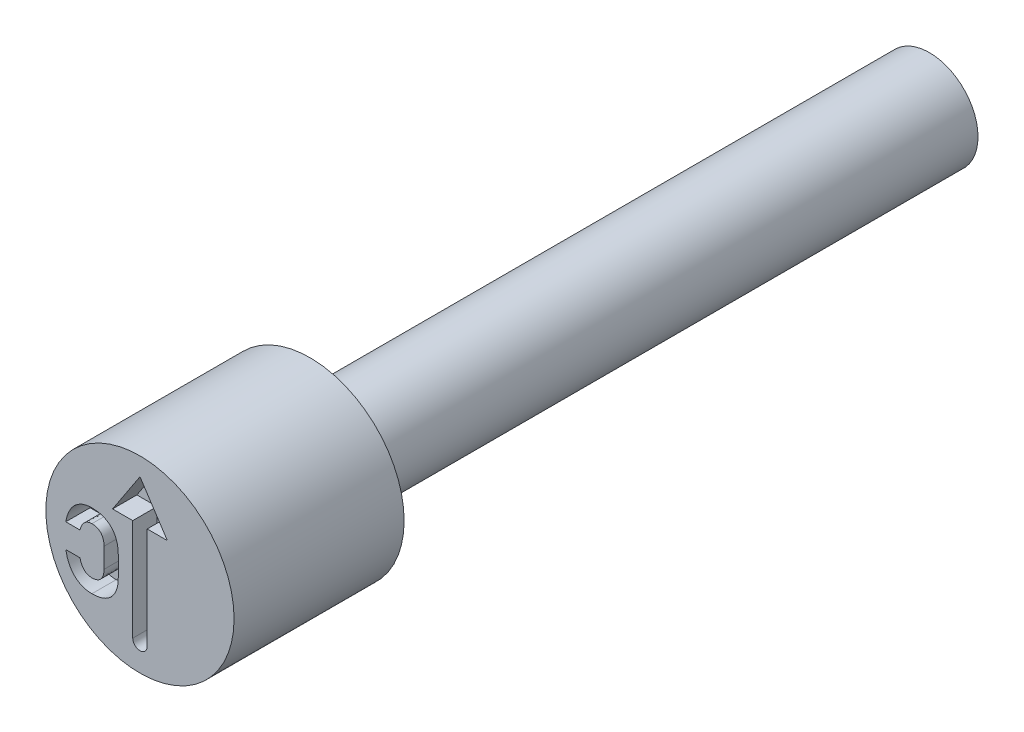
from build123d import *

# Parameters (mm, degrees)
CUT_EXTRUDE4_DEPTH = 0.4
CUT_EXTRUDE5_DEPTH = 0.4


with BuildPart() as part:
    # Sketch2 → Revolve1 (revolve)
    with BuildSketch(Plane(origin=(0, 0, 0), x_dir=(0, 0, -1), z_dir=(1, 0, 0)), mode=Mode.PRIVATE) as revolve1_sk:
        Polygon((0, 1.55), (0, 0), (13, 0), (13, 0.8), (2.8, 0.8), (2.8, 1.55), align=None)
    revolve(revolve1_sk.sketch.rotate(Axis((0, 0, -0.403888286), (0, 0, -1)), 90), axis=Axis((0, 0, -0.403888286), (0, 0, -1)))

    # Sketch3 → Cut-Extrude4 (cut)
    with BuildSketch(Plane.XY):
        with BuildLine():
            Line((0.119045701, 0.566469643), (0.119045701, -1.110101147))
            ThreePointArc((0.119045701, -1.110101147), (0, -1.229146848), (-0.119045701, -1.110101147))
            Line((-0.119045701, -1.110101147), (-0.119045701, 0.566469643))
            Line((-0.119045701, 0.566469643), (-0.451198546, 0.566469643))
            Line((-0.451198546, 0.566469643), (0, 1.251322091))
            Line((0, 1.251322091), (0.451198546, 0.566469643))
            Line((0.451198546, 0.566469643), (0.119045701, 0.566469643))
        make_face()
    extrude(amount=-CUT_EXTRUDE4_DEPTH, mode=Mode.SUBTRACT)

    # Sketch4 → Cut-Extrude5 (cut)
    with BuildSketch(Plane.XY):
        with BuildLine():
            add(Edge.make_bspline(
                [(-0.791430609, -0.812471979), (-0.780258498, -0.812351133), (-0.75821246, -0.812112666), (-0.725795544, -0.809631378), (-0.694521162, -0.805483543), (-0.664559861, -0.799634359), (-0.635828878, -0.792255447), (-0.608205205, -0.783533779), (-0.581954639, -0.772736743), (-0.556822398, -0.760492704), (-0.533162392, -0.746634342), (-0.511024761, -0.731046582), (-0.490189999, -0.714218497), (-0.470816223, -0.695812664), (-0.452923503, -0.675936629), (-0.436410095, -0.654568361), (-0.421615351, -0.631571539), (-0.408081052, -0.607256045), (-0.396039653, -0.581555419), (-0.38587658, -0.554346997), (-0.377065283, -0.525931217), (-0.369694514, -0.496312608), (-0.364051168, -0.465356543), (-0.36028953, -0.433086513), (-0.357681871, -0.39947215), (-0.357466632, -0.376610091), (-0.357356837, -0.364948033)],
                knots=[0, 0, 0, 0, 1.134237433, 2.238201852, 3.298772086, 4.336057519, 5.335809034, 6.309558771, 7.274828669, 8.21507465, 9.146315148, 10.055631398, 10.961815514, 11.863452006, 12.765999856, 13.674901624, 14.60241943, 15.539819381, 16.498894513, 17.481225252, 18.486546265, 19.518401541, 20.578551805, 21.679128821, 22.816111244, 24, 24, 24, 24], degree=3))
            Line((-0.357356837, -0.364948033), (-0.357356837, -0.035785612))
            add(Edge.make_bspline(
                [(-0.357356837, -0.035785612), (-0.357466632, -0.024123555), (-0.357681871, -0.001261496), (-0.360289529, 0.032352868), (-0.36405117, 0.064622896), (-0.369694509, 0.095578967), (-0.377065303, 0.125197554), (-0.385876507, 0.153613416), (-0.396039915, 0.180821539), (-0.408080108, 0.206523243), (-0.421618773, 0.230834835), (-0.436397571, 0.253845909), (-0.453006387, 0.275210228), (-0.470729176, 0.295319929), (-0.490200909, 0.313720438), (-0.511024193, 0.330554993), (-0.533153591, 0.346164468), (-0.556890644, 0.359945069), (-0.581878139, 0.372572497), (-0.608264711, 0.383198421), (-0.635774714, 0.392337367), (-0.664568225, 0.39960951), (-0.694518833, 0.405490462), (-0.725796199, 0.409629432), (-0.758212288, 0.412113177), (-0.78025844, 0.412351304), (-0.791430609, 0.412471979)],
                knots=[0, 0, 0, 0, 1.183277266, 2.319672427, 3.419680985, 4.479283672, 5.510605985, 6.515407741, 7.497231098, 8.455810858, 9.392726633, 10.319765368, 11.22819768, 12.136441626, 13.037612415, 13.943328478, 14.852175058, 15.782934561, 16.726365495, 17.691136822, 18.666946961, 19.666182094, 20.70293176, 21.7629542, 22.866348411, 24, 24, 24, 24], degree=3))
            add(Edge.make_bspline(
                [(-0.791430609, 0.412471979), (-0.80981555, 0.411979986), (-0.845854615, 0.411015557), (-0.898234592, 0.40133204), (-0.947698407, 0.386255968), (-0.993956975, 0.364758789), (-1.036865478, 0.337635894), (-1.075921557, 0.304635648), (-1.111112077, 0.266190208), (-1.142133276, 0.222142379), (-1.169073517, 0.173106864), (-1.191251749, 0.119077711), (-1.209253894, 0.060457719), (-1.217243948, 0.019327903), (-1.221347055, -0.001793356)],
                knots=[0, 0, 0, 0, 1.00806925, 1.976066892, 2.912865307, 3.839664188, 4.766819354, 5.690806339, 6.637604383, 7.619531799, 8.640729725, 9.701744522, 10.819784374, 12, 12, 12, 12], degree=3))
            Line((-1.221347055, -0.001793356), (-0.987069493, -0.001793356))
            add(Edge.make_bspline(
                [(-0.987069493, -0.001793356), (-0.984706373, 0.007792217), (-0.980107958, 0.026444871), (-0.970640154, 0.052979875), (-0.959874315, 0.077558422), (-0.946707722, 0.099594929), (-0.932374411, 0.119621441), (-0.916209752, 0.13697175), (-0.898567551, 0.151933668), (-0.879584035, 0.164308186), (-0.859310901, 0.174393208), (-0.83765588, 0.181067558), (-0.814917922, 0.185425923), (-0.799358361, 0.185981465), (-0.791430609, 0.18626452)],
                knots=[0, 0, 0, 0, 1.203096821, 2.341117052, 3.431111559, 4.469295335, 5.465369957, 6.42892467, 7.35290722, 8.279239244, 9.186115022, 10.104036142, 11.033987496, 12, 12, 12, 12], degree=3))
            add(Edge.make_bspline(
                [(-0.791430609, 0.18626452), (-0.781226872, 0.185907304), (-0.76152332, 0.185217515), (-0.73297918, 0.180723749), (-0.706978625, 0.172258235), (-0.683158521, 0.161027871), (-0.661879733, 0.146482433), (-0.643370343, 0.128650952), (-0.627621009, 0.107775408), (-0.614349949, 0.084215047), (-0.604088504, 0.057770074), (-0.596868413, 0.028766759), (-0.592400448, -0.00271483), (-0.591895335, -0.024520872), (-0.5916344, -0.035785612)],
                knots=[0, 0, 0, 0, 1.082677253, 2.090664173, 3.053339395, 3.973921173, 4.875832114, 5.774919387, 6.688160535, 7.640683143, 8.634736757, 9.687648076, 10.805466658, 12, 12, 12, 12], degree=3))
            Line((-0.5916344, -0.035785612), (-0.5916344, -0.364948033))
            add(Edge.make_bspline(
                [(-0.5916344, -0.364948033), (-0.591898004, -0.37621205), (-0.592408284, -0.398016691), (-0.596829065, -0.429429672), (-0.604142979, -0.458324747), (-0.614290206, -0.48465266), (-0.627619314, -0.50803769), (-0.643448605, -0.528668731), (-0.661869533, -0.546495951), (-0.683168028, -0.561000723), (-0.706927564, -0.572346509), (-0.733057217, -0.580321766), (-0.761487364, -0.585328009), (-0.781219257, -0.585945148), (-0.791430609, -0.58626452)],
                knots=[0, 0, 0, 0, 1.196920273, 2.316972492, 3.363591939, 4.359631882, 5.306515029, 6.214703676, 7.115587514, 8.019300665, 8.94172196, 9.903709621, 10.915159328, 12, 12, 12, 12], degree=3))
            add(Edge.make_bspline(
                [(-0.791430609, -0.58626452), (-0.799513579, -0.585946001), (-0.815367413, -0.585321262), (-0.838528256, -0.581496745), (-0.860334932, -0.574448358), (-0.880934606, -0.564951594), (-0.90017628, -0.552681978), (-0.917511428, -0.537522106), (-0.933658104, -0.520265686), (-0.948029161, -0.500350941), (-0.960768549, -0.478065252), (-0.971422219, -0.453400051), (-0.980669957, -0.426630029), (-0.984892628, -0.407713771), (-0.987069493, -0.397962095)],
                knots=[0, 0, 0, 0, 0.981077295, 1.924272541, 2.837745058, 3.753838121, 4.670304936, 5.59622504, 6.54113043, 7.532377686, 8.569122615, 9.649813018, 10.788435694, 12, 12, 12, 12], degree=3))
            Line((-0.987069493, -0.397962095), (-1.221347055, -0.397962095))
            add(Edge.make_bspline(
                [(-1.221347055, -0.397962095), (-1.217167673, -0.419166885), (-1.209042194, -0.460392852), (-1.190782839, -0.519101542), (-1.168281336, -0.573041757), (-1.141503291, -0.622132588), (-1.110285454, -0.66588861), (-1.075374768, -0.704473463), (-1.036476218, -0.737561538), (-0.993669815, -0.764820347), (-0.947448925, -0.786249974), (-0.898066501, -0.801299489), (-0.845777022, -0.811035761), (-0.809816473, -0.811986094), (-0.791430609, -0.812471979)],
                knots=[0, 0, 0, 0, 1.185884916, 2.305575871, 3.368634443, 4.390138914, 5.368714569, 6.312778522, 7.23993122, 8.163588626, 9.090665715, 10.027745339, 10.991628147, 12, 12, 12, 12], degree=3))
        make_face()
    extrude(amount=-CUT_EXTRUDE5_DEPTH, mode=Mode.SUBTRACT)


solid = part.part
